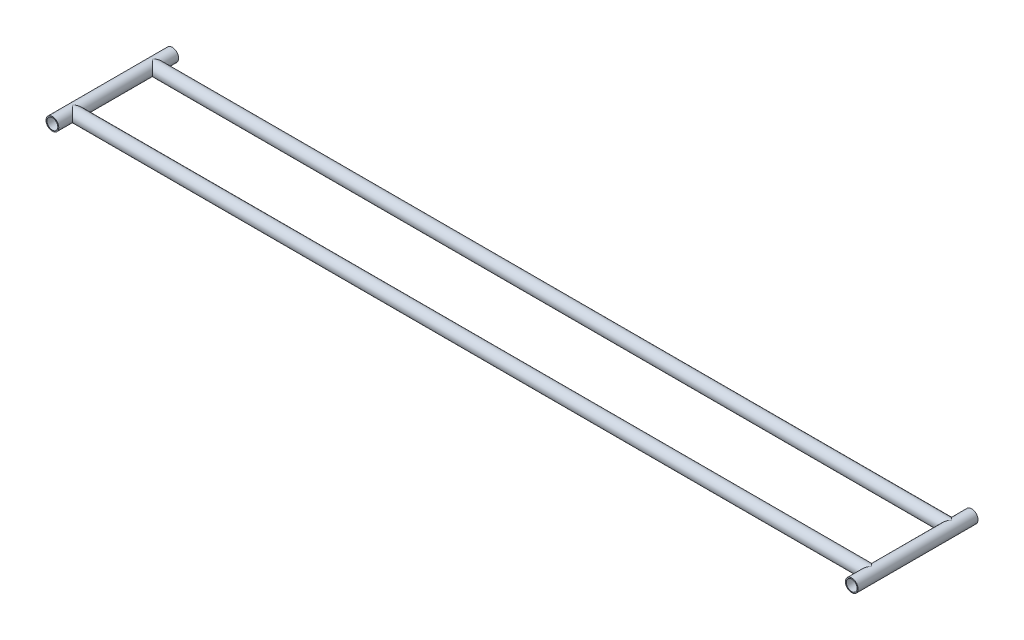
from build123d import *

# Parameters (mm, degrees)
SKETCH1_R                = 8
SKETCH1_R_2              = 6.75
BOSS_EXTRUDE1_DEPTH      = 1000
BOSS_EXTRUDE1_2_DEPTH    = 1000
BOSS_EXTRUDE2_DEPTH      = 75
BOSS_EXTRUDE2_DEPTH_BACK = 75
SKETCH2_R                = 8
SKETCH2_R_2              = 6.75
CUT_EXTRUDE1_START       = -150
SKETCH3_R                = 6.75
CUT_EXTRUDE1_DEPTH       = 150
BOSS_EXTRUDE3_DEPTH      = 75
BOSS_EXTRUDE3_DEPTH_BACK = 75
SKETCH4_R                = 8
SKETCH4_R_2              = 6.75
SKETCH6_R                = 6.75
CUT_EXTRUDE2_DEPTH       = 150


with BuildPart() as part:
    # Sketch1 → Boss-Extrude1 (new body)
    with BuildSketch(Plane(origin=(0, 0, 0), x_dir=(0, 0, -1), z_dir=(1, 0, 0))):
        with Locations((-50, 0)):
            Circle(SKETCH1_R)
        with Locations((-50, 0)):
            Circle(SKETCH1_R_2, mode=Mode.SUBTRACT)
    extrude(amount=BOSS_EXTRUDE1_DEPTH)



with BuildPart() as body_2:
    # Sketch1 → Boss-Extrude1 2 (new body)
    with BuildSketch(Plane(origin=(0, 0, 0), x_dir=(0, 0, -1), z_dir=(1, 0, 0))):
        with Locations((50, 0)):
            Circle(SKETCH1_R)
        with Locations((50, 0)):
            Circle(SKETCH1_R_2, mode=Mode.SUBTRACT)
    extrude(amount=BOSS_EXTRUDE1_2_DEPTH)


with BuildPart() as part_1:
    add(part.part)

    add(body_2.part)  # Boss-Extrude2 merges body 2
    # Sketch2 → Boss-Extrude2 (add, two sides: drawn at the far end of the back side and taken through both)
    with BuildSketch(Plane.XY.offset(-BOSS_EXTRUDE2_DEPTH_BACK)):
        Circle(SKETCH2_R)
        Circle(SKETCH2_R_2, mode=Mode.SUBTRACT)
    extrude(amount=BOSS_EXTRUDE2_DEPTH + BOSS_EXTRUDE2_DEPTH_BACK)

    # Sketch3 → Cut-Extrude1 (cut)
    with BuildSketch(Plane.XY.offset(75).offset(CUT_EXTRUDE1_START)):
        Circle(SKETCH3_R)
    extrude(amount=CUT_EXTRUDE1_DEPTH, mode=Mode.SUBTRACT)

    # Sketch4 → Boss-Extrude3 (add, two sides: drawn at the far end of the back side and taken through both)
    with BuildSketch(Plane.XY.offset(-BOSS_EXTRUDE3_DEPTH_BACK)):
        with Locations((1000, 0)):
            Circle(SKETCH4_R)
        with Locations((1000, 0)):
            Circle(SKETCH4_R_2, mode=Mode.SUBTRACT)
    extrude(amount=BOSS_EXTRUDE3_DEPTH + BOSS_EXTRUDE3_DEPTH_BACK)

    # Sketch6 → Cut-Extrude2 (cut)
    with BuildSketch(Plane.XY.offset(75)):
        with Locations((1000, 0)):
            Circle(SKETCH6_R)
    extrude(amount=-CUT_EXTRUDE2_DEPTH, mode=Mode.SUBTRACT)


solid = part_1.part
